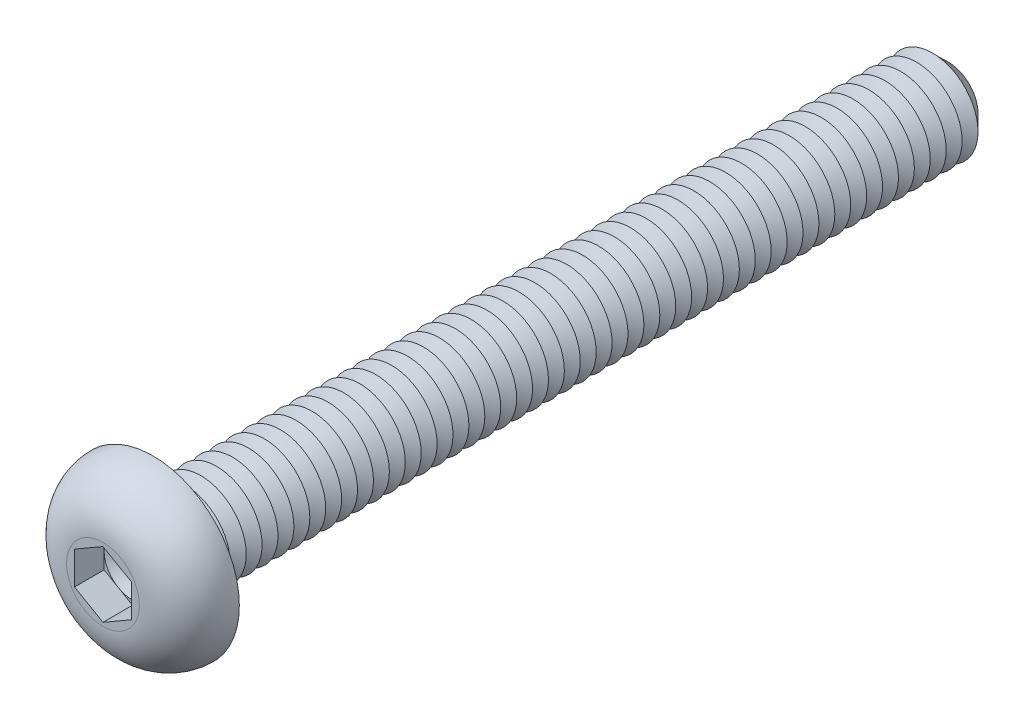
from build123d import *

# Parameters (mm, degrees)
CUT_EXTRUDE1_DEPTH  = 1.3
SKETCH4_R           = 2
BOSS_EXTRUDE1_DEPTH = 35
CHAMFER1_SIZE       = 0.7
LPATTERN1_COUNT     = 48
LPATTERN1_PITCH     = 0.7
FILLET2_R           = 0.3


with BuildPart() as part:
    # Sketch2 → Revolve1 (revolve)
    with BuildSketch(Plane(origin=(0, 0, 0), x_dir=(0, 0, -1), z_dir=(1, 0, 0)), mode=Mode.PRIVATE) as revolve1_sk:
        with BuildLine():
            Line((0, 0), (-2.2, 0))
            Line((-2.2, 0), (-2.2, 1.6))
            ThreePointArc((-2.2, 1.6), (-1.555634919, 3.155634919), (0, 3.8))
            Line((0, 3.8), (0, 0))
        make_face()
    revolve(revolve1_sk.sketch.rotate(Axis((0, 0, 47.934239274), (0, 0, -1)), 90), axis=Axis((0, 0, 47.934239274), (0, 0, -1)))

    # Sketch3 → Cut-Extrude1 (cut)
    with BuildSketch(Plane.XY.offset(2.2)):
        Polygon((0, 1.443375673), (-1.25, 0.721687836), (-1.25, -0.721687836), (0, -1.443375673), (1.25, -0.721687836), (1.25, 0.721687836), align=None)
    extrude(amount=-CUT_EXTRUDE1_DEPTH, mode=Mode.SUBTRACT)

    # Sketch4 → Boss-Extrude1 (add)
    with BuildSketch(Plane(origin=(0, 0, 0), x_dir=(-1, 0, 0), z_dir=(0, 0, -1))):
        with Locations(Location((0, 0, 0), (0, 0, 180))):
            Circle(SKETCH4_R)
    extrude(amount=BOSS_EXTRUDE1_DEPTH)

    # Chamfer1
    chamfer1_edges = [part.edges().sort_by_distance(p)[0] for p in [
        (-2, 0, -35),
    ]]
    chamfer(chamfer1_edges, length=CHAMFER1_SIZE)

    # Sketch5 → Cut-Revolve1 (revolve, cut)
    with BuildSketch(Plane(origin=(0, 0, 0), x_dir=(0, 0, -1), z_dir=(1, 0, 0)), mode=Mode.PRIVATE) as cut_revolve1_sk:
        Polygon((0.7, 2), (1.4, 2), (1.05, 1.393782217), align=None)
    cut_revolve1 = revolve(cut_revolve1_sk.sketch.rotate(Axis((0, 0, 47.934239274), (0, 0, -1)), 90), axis=Axis((0, 0, 47.934239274), (0, 0, -1)), mode=Mode.SUBTRACT)

    # LPattern1: Cut-Revolve1 ×48
    with Locations(*[(0, 0, -i * LPATTERN1_PITCH) for i in range(1, LPATTERN1_COUNT)]):
        add(cut_revolve1, mode=Mode.SUBTRACT)

    # Fillet2
    fillet2_edges = [part.edges().sort_by_distance(p)[0] for p in [
        (-2, 0, 0),
    ]]
    fillet(fillet2_edges, radius=FILLET2_R)

    # Cut-Extrude2 cone 1 section (on through the dimple's axis) → Cut-Extrude2 (revolve, cut)
    with BuildSketch(Plane(origin=(0, 0, 0.9), x_dir=(0, -1, 0), z_dir=(1, 0, 0))):
        Polygon((0, 0), (1.25, 0), (0, 0.721687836), align=None)
    revolve(axis=Axis((0, 0, 0.9), (0, 0, -1)), mode=Mode.SUBTRACT)


solid = part.part
